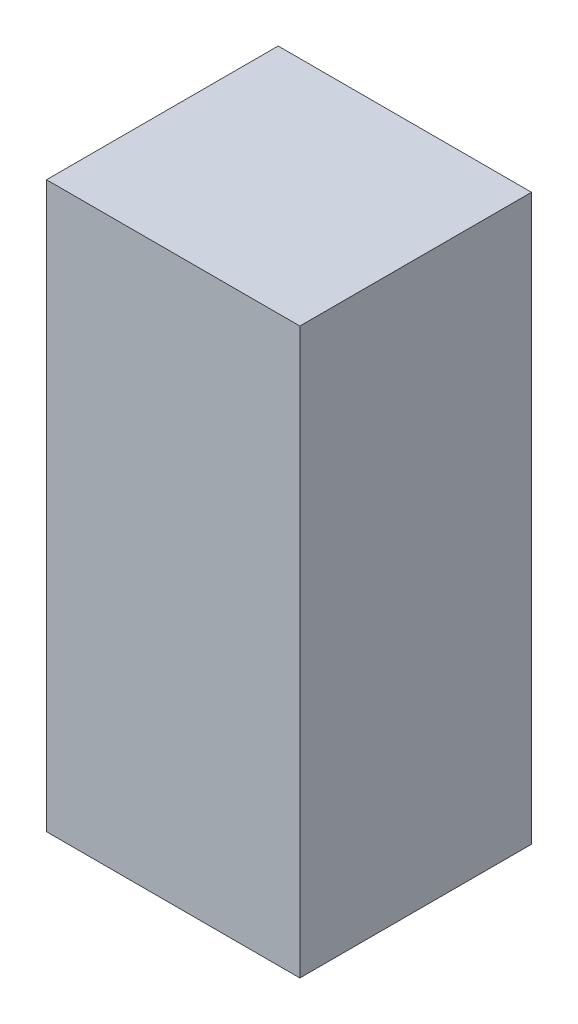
ISO-10303-21;
HEADER;
FILE_DESCRIPTION(('STEP AP214'),'2;1');
FILE_NAME('part.step','',(''),(''),'','','');
FILE_SCHEMA(('AUTOMOTIVE_DESIGN { 1 0 10303 214 1 1 1 1 }'));
ENDSEC;
DATA;
#1=APPLICATION_CONTEXT('core data for automotive mechanical design processes');
#2=APPLICATION_PROTOCOL_DEFINITION('international standard','automotive_design',2000,#1);
#3=PRODUCT_CONTEXT('',#1,'mechanical');
#4=PRODUCT('Part','Part','',(#3));
#5=PRODUCT_RELATED_PRODUCT_CATEGORY('part','',(#4));
#6=PRODUCT_DEFINITION_FORMATION('','',#4);
#7=PRODUCT_DEFINITION_CONTEXT('part definition',#1,'design');
#8=PRODUCT_DEFINITION('design','',#6,#7);
#9=PRODUCT_DEFINITION_SHAPE('','',#8);
#10=(LENGTH_UNIT() NAMED_UNIT(*) SI_UNIT(.MILLI.,.METRE.));
#11=(NAMED_UNIT(*) PLANE_ANGLE_UNIT() SI_UNIT($,.RADIAN.));
#12=(NAMED_UNIT(*) SI_UNIT($,.STERADIAN.) SOLID_ANGLE_UNIT());
#13=UNCERTAINTY_MEASURE_WITH_UNIT(LENGTH_MEASURE(1.E-05),#10,'distance_accuracy_value','');
#14=(GEOMETRIC_REPRESENTATION_CONTEXT(3) GLOBAL_UNCERTAINTY_ASSIGNED_CONTEXT((#13)) GLOBAL_UNIT_ASSIGNED_CONTEXT((#10,
#11,#12)) REPRESENTATION_CONTEXT('',''));
#15=CARTESIAN_POINT('',(0.,0.,0.));
#16=DIRECTION('',(0.,0.,1.));
#17=DIRECTION('',(1.,0.,0.));
#18=AXIS2_PLACEMENT_3D('',#15,#16,#17);
#19=CARTESIAN_POINT('',(0.,0.,1.59999934));
#20=DIRECTION('',(0.,0.,1.));
#21=DIRECTION('',(1.,0.,0.));
#22=AXIS2_PLACEMENT_3D('',#19,#20,#21);
#23=PLANE('',#22);
#24=DIRECTION('',(-1.,0.,0.));
#25=VECTOR('',#24,1.);
#26=CARTESIAN_POINT('',(0.87499952,1.95000118,1.59999934));
#27=LINE('',#26,#25);
#28=CARTESIAN_POINT('',(0.87499952,1.95000118,1.59999934));
#29=VERTEX_POINT('',#28);
#30=CARTESIAN_POINT('',(-0.87499952,1.95000118,1.59999934));
#31=VERTEX_POINT('',#30);
#32=EDGE_CURVE('E82',#29,#31,#27,.T.);
#33=ORIENTED_EDGE('',*,*,#32,.T.);
#34=DIRECTION('',(0.,-1.,0.));
#35=VECTOR('',#34,1.);
#36=CARTESIAN_POINT('',(-0.87499952,1.95000118,1.59999934));
#37=LINE('',#36,#35);
#38=CARTESIAN_POINT('',(-0.87499952,-1.95000118,1.59999934));
#39=VERTEX_POINT('',#38);
#40=EDGE_CURVE('E106',#31,#39,#37,.T.);
#41=ORIENTED_EDGE('',*,*,#40,.T.);
#42=DIRECTION('',(1.,0.,0.));
#43=VECTOR('',#42,1.);
#44=CARTESIAN_POINT('',(-0.87499952,-1.95000118,1.59999934));
#45=LINE('',#44,#43);
#46=CARTESIAN_POINT('',(0.87499952,-1.95000118,1.59999934));
#47=VERTEX_POINT('',#46);
#48=EDGE_CURVE('E75',#39,#47,#45,.T.);
#49=ORIENTED_EDGE('',*,*,#48,.T.);
#50=DIRECTION('',(0.,1.,0.));
#51=VECTOR('',#50,1.);
#52=CARTESIAN_POINT('',(0.87499952,-1.95000118,1.59999934));
#53=LINE('',#52,#51);
#54=EDGE_CURVE('E11',#47,#29,#53,.T.);
#55=ORIENTED_EDGE('',*,*,#54,.T.);
#56=EDGE_LOOP('',(#33,#41,#49,#55));
#57=FACE_BOUND('',#56,.T.);
#58=ADVANCED_FACE('F17',(#57),#23,.T.);
#59=CARTESIAN_POINT('',(0.,0.,0.));
#60=DIRECTION('',(0.,0.,1.));
#61=DIRECTION('',(1.,0.,0.));
#62=AXIS2_PLACEMENT_3D('',#59,#60,#61);
#63=PLANE('',#62);
#64=DIRECTION('',(0.,1.,0.));
#65=VECTOR('',#64,1.);
#66=CARTESIAN_POINT('',(0.87499952,-1.95000118,0.));
#67=LINE('',#66,#65);
#68=CARTESIAN_POINT('',(0.87499952,-1.95000118,0.));
#69=VERTEX_POINT('',#68);
#70=CARTESIAN_POINT('',(0.87499952,1.95000118,0.));
#71=VERTEX_POINT('',#70);
#72=EDGE_CURVE('E20',#69,#71,#67,.T.);
#73=ORIENTED_EDGE('',*,*,#72,.F.);
#74=DIRECTION('',(1.,0.,0.));
#75=VECTOR('',#74,1.);
#76=CARTESIAN_POINT('',(-0.87499952,-1.95000118,0.));
#77=LINE('',#76,#75);
#78=CARTESIAN_POINT('',(-0.87499952,-1.95000118,0.));
#79=VERTEX_POINT('',#78);
#80=EDGE_CURVE('E103',#79,#69,#77,.T.);
#81=ORIENTED_EDGE('',*,*,#80,.F.);
#82=DIRECTION('',(0.,-1.,0.));
#83=VECTOR('',#82,1.);
#84=CARTESIAN_POINT('',(-0.87499952,1.95000118,0.));
#85=LINE('',#84,#83);
#86=CARTESIAN_POINT('',(-0.87499952,1.95000118,0.));
#87=VERTEX_POINT('',#86);
#88=EDGE_CURVE('E84',#87,#79,#85,.T.);
#89=ORIENTED_EDGE('',*,*,#88,.F.);
#90=DIRECTION('',(-1.,0.,0.));
#91=VECTOR('',#90,1.);
#92=CARTESIAN_POINT('',(0.87499952,1.95000118,0.));
#93=LINE('',#92,#91);
#94=EDGE_CURVE('E80',#71,#87,#93,.T.);
#95=ORIENTED_EDGE('',*,*,#94,.F.);
#96=EDGE_LOOP('',(#73,#81,#89,#95));
#97=FACE_BOUND('',#96,.T.);
#98=ADVANCED_FACE('F86',(#97),#63,.F.);
#99=CARTESIAN_POINT('',(0.87499952,-1.95000118,0.));
#100=DIRECTION('',(-1.,0.,0.));
#101=DIRECTION('',(0.,0.,1.));
#102=AXIS2_PLACEMENT_3D('',#99,#100,#101);
#103=PLANE('',#102);
#104=ORIENTED_EDGE('',*,*,#72,.T.);
#105=DIRECTION('',(0.,0.,1.));
#106=VECTOR('',#105,1.);
#107=CARTESIAN_POINT('',(0.87499952,1.95000118,0.));
#108=LINE('',#107,#106);
#109=EDGE_CURVE('E69',#71,#29,#108,.T.);
#110=ORIENTED_EDGE('',*,*,#109,.T.);
#111=ORIENTED_EDGE('',*,*,#54,.F.);
#112=DIRECTION('',(0.,0.,1.));
#113=VECTOR('',#112,1.);
#114=CARTESIAN_POINT('',(0.87499952,-1.95000118,0.));
#115=LINE('',#114,#113);
#116=EDGE_CURVE('E72',#69,#47,#115,.T.);
#117=ORIENTED_EDGE('',*,*,#116,.F.);
#118=EDGE_LOOP('',(#104,#110,#111,#117));
#119=FACE_BOUND('',#118,.T.);
#120=ADVANCED_FACE('F68',(#119),#103,.F.);
#121=CARTESIAN_POINT('',(-0.87499952,-1.95000118,0.));
#122=DIRECTION('',(0.,1.,0.));
#123=DIRECTION('',(1.,0.,0.));
#124=AXIS2_PLACEMENT_3D('',#121,#122,#123);
#125=PLANE('',#124);
#126=ORIENTED_EDGE('',*,*,#80,.T.);
#127=ORIENTED_EDGE('',*,*,#116,.T.);
#128=ORIENTED_EDGE('',*,*,#48,.F.);
#129=DIRECTION('',(0.,0.,1.));
#130=VECTOR('',#129,1.);
#131=CARTESIAN_POINT('',(-0.87499952,-1.95000118,0.));
#132=LINE('',#131,#130);
#133=EDGE_CURVE('E102',#79,#39,#132,.T.);
#134=ORIENTED_EDGE('',*,*,#133,.F.);
#135=EDGE_LOOP('',(#126,#127,#128,#134));
#136=FACE_BOUND('',#135,.T.);
#137=ADVANCED_FACE('F120',(#136),#125,.F.);
#138=CARTESIAN_POINT('',(-0.87499952,1.95000118,0.));
#139=DIRECTION('',(1.,0.,0.));
#140=DIRECTION('',(0.,1.,0.));
#141=AXIS2_PLACEMENT_3D('',#138,#139,#140);
#142=PLANE('',#141);
#143=ORIENTED_EDGE('',*,*,#88,.T.);
#144=ORIENTED_EDGE('',*,*,#133,.T.);
#145=ORIENTED_EDGE('',*,*,#40,.F.);
#146=DIRECTION('',(0.,0.,1.));
#147=VECTOR('',#146,1.);
#148=CARTESIAN_POINT('',(-0.87499952,1.95000118,0.));
#149=LINE('',#148,#147);
#150=EDGE_CURVE('E90',#87,#31,#149,.T.);
#151=ORIENTED_EDGE('',*,*,#150,.F.);
#152=EDGE_LOOP('',(#143,#144,#145,#151));
#153=FACE_BOUND('',#152,.T.);
#154=ADVANCED_FACE('F122',(#153),#142,.F.);
#155=CARTESIAN_POINT('',(0.87499952,1.95000118,0.));
#156=DIRECTION('',(0.,-1.,0.));
#157=DIRECTION('',(0.,0.,-1.));
#158=AXIS2_PLACEMENT_3D('',#155,#156,#157);
#159=PLANE('',#158);
#160=ORIENTED_EDGE('',*,*,#94,.T.);
#161=ORIENTED_EDGE('',*,*,#150,.T.);
#162=ORIENTED_EDGE('',*,*,#32,.F.);
#163=ORIENTED_EDGE('',*,*,#109,.F.);
#164=EDGE_LOOP('',(#160,#161,#162,#163));
#165=FACE_BOUND('',#164,.T.);
#166=ADVANCED_FACE('F78',(#165),#159,.F.);
#167=CLOSED_SHELL('',(#58,#98,#120,#137,#154,#166));
#168=MANIFOLD_SOLID_BREP('B1',#167);
#169=ADVANCED_BREP_SHAPE_REPRESENTATION('',(#18,#168),#14);
#170=SHAPE_DEFINITION_REPRESENTATION(#9,#169);
ENDSEC;
END-ISO-10303-21;
